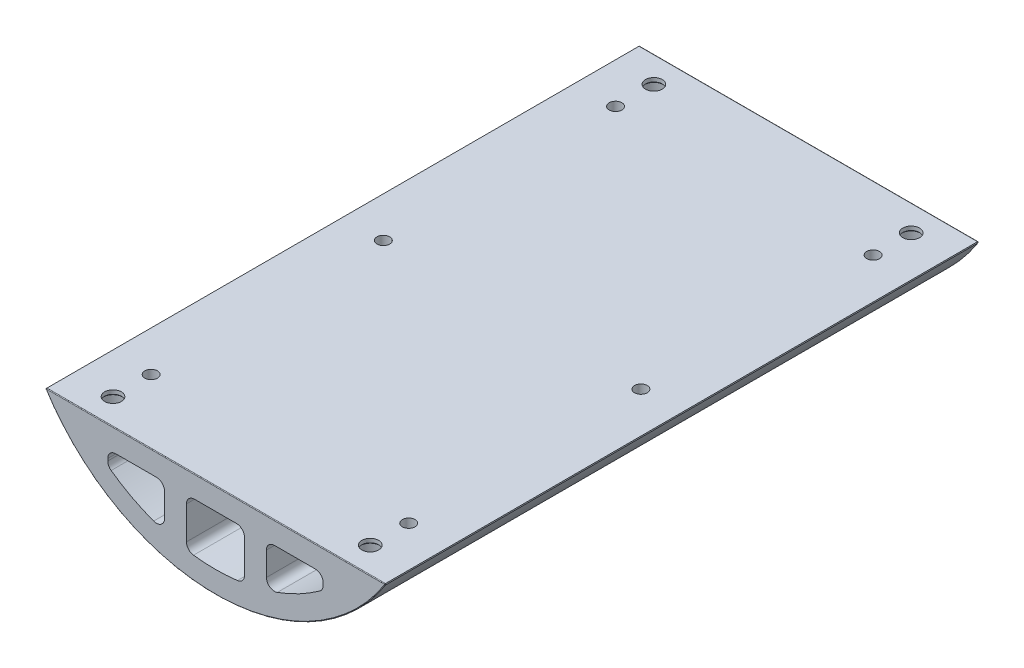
from build123d import *
from OCP.BRepFilletAPI import BRepFilletAPI_MakeChamfer

# Parameters (mm, degrees)
BASE_EXTRUDE_DEPTH    = 58.4
LPATTERN1_COUNT       = 2
LPATTERN1_PITCH       = 106.5
LPATTERN1_COUNT_DIR2  = 2
LPATTERN1_PITCH_DIR2  = 50.65
CHAMFER4_SIZE         = 0.254
CHAMFER4_SIZE2        = 0.184223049
FILLET1_R             = 0.127
CUT_EXTRUDE3_DEPTH    = 128.794055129
M3X0_5_TAPPED_HOLE1_D = 2.5
LPATTERN2_COUNT       = 3
LPATTERN2_PITCH       = 45.72
MIRROR2_COPY_1_D      = 2.5
MIRROR2_COPY_2_D      = 2.5


with BuildPart() as part:
    # Sketch1 → Base-Extrude (new, symmetric)
    with BuildSketch(Plane.XY):
        with BuildLine():
            Line((-33.55012149, -21.082), (33.55012149, -21.082))
            ThreePointArc((33.55012149, -21.082), (0, -39.624), (-33.55012149, -21.082))
        make_face()
    extrude(amount=BASE_EXTRUDE_DEPTH, both=True)

    # Sketch3 → Cut-Revolve1 (revolve, cut)
    with BuildSketch(Plane.XY.offset(53.25)):
        with BuildLine():
            Line((-25.325, -15.956072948), (-26.976, -15.956072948))
            Line((-26.976, -15.956072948), (-26.976, -21.844))
            Line((-26.976, -21.844), (-27.23, -22.098))
            Line((-27.23, -22.098), (-28.3095, -22.098))
            ThreePointArc((-28.3095, -22.098), (-28.399302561, -22.135197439), (-28.4365, -22.225))
            Line((-28.4365, -22.225), (-28.4365, -38.7043245))
            Line((-28.4365, -38.7043245), (-25.325, -38.7043245))
            Line((-25.325, -38.7043245), (-25.325, -15.956072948))
        make_face()
    cut_revolve1 = revolve(axis=Axis((-25.325, -8.96835063, 53.25), (0, -1, 0)), mode=Mode.SUBTRACT)

    # LPattern1: Cut-Revolve1 2 × 2
    with Locations(*[(j * LPATTERN1_PITCH_DIR2, 0, -i * LPATTERN1_PITCH) for i in range(LPATTERN1_COUNT) for j in range(LPATTERN1_COUNT_DIR2) if (i, j) != (0, 0)]):
        add(cut_revolve1, mode=Mode.SUBTRACT)

    # Chamfer4: one chamfer whose edges measure the first distance from different faces: ONE call of the kernel's chamfer builder (chamfer() names one face for all edges)
    chamfer4_edges_1 = [part.edges().sort_by_distance(p)[0] for p in [
        (-33.55012149, -21.082, 0),
    ]]
    chamfer4_side_1 = [part.faces().sort_by_distance(p)[0] for p in [
        (0, -21.082, 0),
    ]]
    chamfer4_edges_2 = [part.edges().sort_by_distance(p)[0] for p in [
        (33.55012149, -21.082, 0),
    ]]
    chamfer4_side_2 = [part.faces().sort_by_distance(p)[0] for p in [
        (0, -39.624, 0),
    ]]
    chamfer4 = BRepFilletAPI_MakeChamfer(part.part.solid().wrapped)
    for e in chamfer4_edges_1:
        chamfer4.Add(CHAMFER4_SIZE, CHAMFER4_SIZE2, e.wrapped, chamfer4_side_1[0].wrapped)  # the first distance lies on this face
    for e in chamfer4_edges_2:
        chamfer4.Add(CHAMFER4_SIZE, CHAMFER4_SIZE2, e.wrapped, chamfer4_side_2[0].wrapped)  # the first distance lies on this face
    add(Compound.cast(chamfer4.Shape()), mode=Mode.REPLACE)

    # Fillet1
    fillet1_edges = [part.edges().sort_by_distance(p)[0] for p in [
        (-0.034888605, -39.62398464, -58.4),
        (-0.034888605, -39.62398464, 58.4),
        (0.034888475, -21.082, -58.4),
        (33.390095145, -21.189315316, -58.4),
        (-33.373932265, -21.159877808, -58.4),
        (0.034888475, -21.082, 58.4),
        (33.390095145, -21.189315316, 58.4),
        (-33.373932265, -21.159877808, 58.4),
    ]]
    fillet(fillet1_edges, radius=FILLET1_R)

    # Sketch6 → Cut-Extrude3 (cut, through all)
    with BuildSketch(Plane.XY.offset(58.4)):
        with BuildLine():
            Line((-19.6215, -25.4), (-11.6205, -25.4))
            ThreePointArc((-11.6205, -25.4), (-10.497967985, -25.864967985), (-10.033, -26.9875))
            Line((-10.033, -26.9875), (-10.033, -31.652823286))
            ThreePointArc((-10.033, -31.652823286), (-10.71175696, -32.954492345), (-12.16760452, -33.143069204))
            ThreePointArc((-12.16760452, -33.143069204), (-16.505790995, -31.210134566), (-20.545299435, -28.712441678))
            ThreePointArc((-20.545299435, -28.712441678), (-21.033358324, -28.147233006), (-21.209, -27.421414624))
            Line((-21.209, -27.421414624), (-21.209, -26.9875))
            ThreePointArc((-21.209, -26.9875), (-20.744032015, -25.864967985), (-19.6215, -25.4))
        make_face()
        with BuildLine():
            Line((-5.715, -26.9875), (-5.715, -33.464921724))
            ThreePointArc((-5.715, -33.464921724), (-5.316753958, -34.516506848), (-4.321826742, -35.040483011))
            ThreePointArc((-4.321826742, -35.040483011), (0, -35.306), (4.321826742, -35.040483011))
            ThreePointArc((4.321826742, -35.040483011), (5.316753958, -34.516506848), (5.715, -33.464921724))
            Line((5.715, -33.464921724), (5.715, -26.9875))
            ThreePointArc((5.715, -26.9875), (5.250032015, -25.864967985), (4.1275, -25.4))
            Line((4.1275, -25.4), (-4.1275, -25.4))
            ThreePointArc((-4.1275, -25.4), (-5.250032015, -25.864967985), (-5.715, -26.9875))
        make_face()
        with BuildLine():
            Line((21.209, -26.9875), (21.209, -27.421414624))
            ThreePointArc((21.209, -27.421414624), (21.033358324, -28.147233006), (20.545299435, -28.712441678))
            ThreePointArc((20.545299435, -28.712441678), (16.505790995, -31.210134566), (12.16760452, -33.143069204))
            ThreePointArc((12.16760452, -33.143069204), (10.71175696, -32.954492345), (10.033, -31.652823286))
            Line((10.033, -31.652823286), (10.033, -26.9875))
            ThreePointArc((10.033, -26.9875), (10.497967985, -25.864967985), (11.6205, -25.4))
            Line((11.6205, -25.4), (19.6215, -25.4))
            ThreePointArc((19.6215, -25.4), (20.744032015, -25.864967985), (21.209, -26.9875))
        make_face()
    extrude(amount=-CUT_EXTRUDE3_DEPTH, mode=Mode.SUBTRACT)

    # M3x0.5 Tapped Hole1 (through all)
    with Locations(Plane(origin=(25.364898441, -21.082, -45.72), x_dir=(0, 0, 1), z_dir=(0, 1, 0))):
        with Locations((0, 0)):
            m3x0_5_tapped_hole1 = Hole(M3X0_5_TAPPED_HOLE1_D / 2)

    # LPattern2: M3x0.5 Tapped Hole1 ×3
    with Locations(*[(0, 0, i * LPATTERN2_PITCH) for i in range(1, LPATTERN2_COUNT)]):
        add(m3x0_5_tapped_hole1, mode=Mode.SUBTRACT)

    # Mirror2: M3x0.5 Tapped Hole1 across plane
    add(m3x0_5_tapped_hole1.mirror(Plane.ZY.offset(-0.010550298)), mode=Mode.SUBTRACT)

    # Mirror2 copy 1 (through all)
    with Locations(Plane(origin=(-25.343797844, -21.082, 0), x_dir=(0, 0, 1), z_dir=(0, 1, 0))):
        with Locations((0, 0)):
            Hole(MIRROR2_COPY_1_D / 2)

    # Mirror2 copy 2 (through all)
    with Locations(Plane(origin=(-25.343797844, -21.082, 45.72), x_dir=(0, 0, 1), z_dir=(0, 1, 0))):
        with Locations((0, 0)):
            Hole(MIRROR2_COPY_2_D / 2)


solid = part.part
